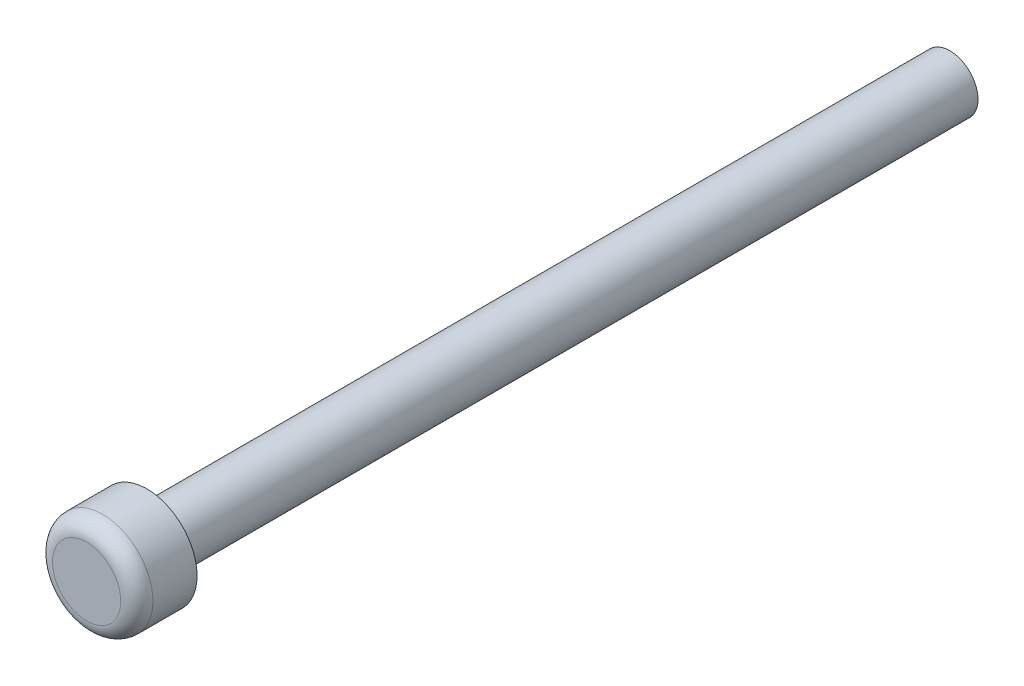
ISO-10303-21;
HEADER;
FILE_DESCRIPTION(('STEP AP214'),'2;1');
FILE_NAME('part.step','',(''),(''),'','','');
FILE_SCHEMA(('AUTOMOTIVE_DESIGN { 1 0 10303 214 1 1 1 1 }'));
ENDSEC;
DATA;
#1=APPLICATION_CONTEXT('core data for automotive mechanical design processes');
#2=APPLICATION_PROTOCOL_DEFINITION('international standard','automotive_design',2000,#1);
#3=PRODUCT_CONTEXT('',#1,'mechanical');
#4=PRODUCT('Part','Part','',(#3));
#5=PRODUCT_RELATED_PRODUCT_CATEGORY('part','',(#4));
#6=PRODUCT_DEFINITION_FORMATION('','',#4);
#7=PRODUCT_DEFINITION_CONTEXT('part definition',#1,'design');
#8=PRODUCT_DEFINITION('design','',#6,#7);
#9=PRODUCT_DEFINITION_SHAPE('','',#8);
#10=(LENGTH_UNIT() NAMED_UNIT(*) SI_UNIT(.MILLI.,.METRE.));
#11=(NAMED_UNIT(*) PLANE_ANGLE_UNIT() SI_UNIT($,.RADIAN.));
#12=(NAMED_UNIT(*) SI_UNIT($,.STERADIAN.) SOLID_ANGLE_UNIT());
#13=UNCERTAINTY_MEASURE_WITH_UNIT(LENGTH_MEASURE(1.E-05),#10,'distance_accuracy_value','');
#14=(GEOMETRIC_REPRESENTATION_CONTEXT(3) GLOBAL_UNCERTAINTY_ASSIGNED_CONTEXT((#13)) GLOBAL_UNIT_ASSIGNED_CONTEXT((#10,
#11,#12)) REPRESENTATION_CONTEXT('',''));
#15=CARTESIAN_POINT('',(0.,0.,0.));
#16=DIRECTION('',(0.,0.,1.));
#17=DIRECTION('',(1.,0.,0.));
#18=AXIS2_PLACEMENT_3D('',#15,#16,#17);
#19=CARTESIAN_POINT('',(212.5,139.,-120.));
#20=DIRECTION('',(0.,0.,1.));
#21=DIRECTION('',(1.,0.,0.));
#22=AXIS2_PLACEMENT_3D('',#19,#20,#21);
#23=CYLINDRICAL_SURFACE('',#22,7.00000000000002);
#24=CARTESIAN_POINT('',(212.5,139.,-120.));
#25=DIRECTION('',(0.,0.,1.));
#26=DIRECTION('',(1.,0.,0.));
#27=AXIS2_PLACEMENT_3D('',#24,#25,#26);
#28=CIRCLE('',#27,7.00000000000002);
#29=CARTESIAN_POINT('',(219.5,139.,-120.));
#30=VERTEX_POINT('',#29);
#31=EDGE_CURVE('E60',#30,#30,#28,.T.);
#32=CARTESIAN_POINT('',(212.5,139.,80.));
#33=DIRECTION('',(0.,0.,1.));
#34=DIRECTION('',(1.,0.,0.));
#35=AXIS2_PLACEMENT_3D('',#32,#33,#34);
#36=CIRCLE('',#35,7.00000000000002);
#37=CARTESIAN_POINT('',(219.5,139.,80.));
#38=VERTEX_POINT('',#37);
#39=EDGE_CURVE('E65',#38,#38,#36,.T.);
#40=CARTESIAN_POINT('',(219.5,139.,-120.));
#41=CARTESIAN_POINT('',(219.5,139.,-117.916666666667));
#42=CARTESIAN_POINT('',(219.5,139.,-115.833333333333));
#43=CARTESIAN_POINT('',(219.5,139.,-111.666666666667));
#44=CARTESIAN_POINT('',(219.5,139.,-109.583333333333));
#45=CARTESIAN_POINT('',(219.5,139.,-105.416666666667));
#46=CARTESIAN_POINT('',(219.5,139.,-103.333333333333));
#47=CARTESIAN_POINT('',(219.5,139.,-99.1666666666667));
#48=CARTESIAN_POINT('',(219.5,139.,-97.0833333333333));
#49=CARTESIAN_POINT('',(219.5,139.,-92.9166666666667));
#50=CARTESIAN_POINT('',(219.5,139.,-90.8333333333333));
#51=CARTESIAN_POINT('',(219.5,139.,-86.6666666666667));
#52=CARTESIAN_POINT('',(219.5,139.,-84.5833333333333));
#53=CARTESIAN_POINT('',(219.5,139.,-80.4166666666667));
#54=CARTESIAN_POINT('',(219.5,139.,-78.3333333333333));
#55=CARTESIAN_POINT('',(219.5,139.,-74.1666666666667));
#56=CARTESIAN_POINT('',(219.5,139.,-72.0833333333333));
#57=CARTESIAN_POINT('',(219.5,139.,-67.9166666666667));
#58=CARTESIAN_POINT('',(219.5,139.,-65.8333333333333));
#59=CARTESIAN_POINT('',(219.5,139.,-61.6666666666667));
#60=CARTESIAN_POINT('',(219.5,139.,-59.5833333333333));
#61=CARTESIAN_POINT('',(219.5,139.,-55.4166666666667));
#62=CARTESIAN_POINT('',(219.5,139.,-53.3333333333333));
#63=CARTESIAN_POINT('',(219.5,139.,-49.1666666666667));
#64=CARTESIAN_POINT('',(219.5,139.,-47.0833333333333));
#65=CARTESIAN_POINT('',(219.5,139.,-42.9166666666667));
#66=CARTESIAN_POINT('',(219.5,139.,-40.8333333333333));
#67=CARTESIAN_POINT('',(219.5,139.,-36.6666666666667));
#68=CARTESIAN_POINT('',(219.5,139.,-34.5833333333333));
#69=CARTESIAN_POINT('',(219.5,139.,-30.4166666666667));
#70=CARTESIAN_POINT('',(219.5,139.,-28.3333333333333));
#71=CARTESIAN_POINT('',(219.5,139.,-24.1666666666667));
#72=CARTESIAN_POINT('',(219.5,139.,-22.0833333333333));
#73=CARTESIAN_POINT('',(219.5,139.,-17.9166666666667));
#74=CARTESIAN_POINT('',(219.5,139.,-15.8333333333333));
#75=CARTESIAN_POINT('',(219.5,139.,-11.6666666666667));
#76=CARTESIAN_POINT('',(219.5,139.,-9.58333333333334));
#77=CARTESIAN_POINT('',(219.5,139.,-5.41666666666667));
#78=CARTESIAN_POINT('',(219.5,139.,-3.33333333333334));
#79=CARTESIAN_POINT('',(219.5,139.,0.833333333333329));
#80=CARTESIAN_POINT('',(219.5,139.,2.91666666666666));
#81=CARTESIAN_POINT('',(219.5,139.,7.08333333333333));
#82=CARTESIAN_POINT('',(219.5,139.,9.16666666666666));
#83=CARTESIAN_POINT('',(219.5,139.,13.3333333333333));
#84=CARTESIAN_POINT('',(219.5,139.,15.4166666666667));
#85=CARTESIAN_POINT('',(219.5,139.,19.5833333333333));
#86=CARTESIAN_POINT('',(219.5,139.,21.6666666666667));
#87=CARTESIAN_POINT('',(219.5,139.,25.8333333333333));
#88=CARTESIAN_POINT('',(219.5,139.,27.9166666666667));
#89=CARTESIAN_POINT('',(219.5,139.,32.0833333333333));
#90=CARTESIAN_POINT('',(219.5,139.,34.1666666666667));
#91=CARTESIAN_POINT('',(219.5,139.,38.3333333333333));
#92=CARTESIAN_POINT('',(219.5,139.,40.4166666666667));
#93=CARTESIAN_POINT('',(219.5,139.,44.5833333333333));
#94=CARTESIAN_POINT('',(219.5,139.,46.6666666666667));
#95=CARTESIAN_POINT('',(219.5,139.,50.8333333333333));
#96=CARTESIAN_POINT('',(219.5,139.,52.9166666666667));
#97=CARTESIAN_POINT('',(219.5,139.,57.0833333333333));
#98=CARTESIAN_POINT('',(219.5,139.,59.1666666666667));
#99=CARTESIAN_POINT('',(219.5,139.,63.3333333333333));
#100=CARTESIAN_POINT('',(219.5,139.,65.4166666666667));
#101=CARTESIAN_POINT('',(219.5,139.,69.5833333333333));
#102=CARTESIAN_POINT('',(219.5,139.,71.6666666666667));
#103=CARTESIAN_POINT('',(219.5,139.,75.8333333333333));
#104=CARTESIAN_POINT('',(219.5,139.,77.9166666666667));
#105=CARTESIAN_POINT('',(219.5,139.,80.));
#106=B_SPLINE_CURVE_WITH_KNOTS('',3,(#40,#41,#42,#43,#44,#45,#46,#47,#48,#49,#50,#51,#52,#53,
#54,#55,#56,#57,#58,#59,#60,#61,#62,#63,#64,#65,#66,#67,#68,#69,#70,#71,#72,#73,#74,#75,#76,#77,
#78,#79,#80,#81,#82,#83,#84,#85,#86,#87,#88,#89,#90,#91,#92,#93,#94,#95,#96,#97,#98,#99,#100,
#101,#102,#103,#104,#105),.UNSPECIFIED.,.F.,.F.,(4,2,2,2,2,2,2,2,2,2,2,2,2,2,2,2,2,2,2,2,2,2,2,
2,2,2,2,2,2,2,2,2,4),(0.,6.25000000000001,12.5,18.75,25.,31.25,37.5,43.75,50.,56.25,62.5,68.75,
75.,81.25,87.5,93.75,100.,106.25,112.5,118.75,125.,131.25,137.5,143.75,150.,156.25,162.5,168.75,
175.,181.25,187.5,193.75,200.),.UNSPECIFIED.);
#107=EDGE_CURVE('BSEAM47',#30,#38,#106,.T.);
#108=ORIENTED_EDGE('',*,*,#31,.T.);
#109=ORIENTED_EDGE('',*,*,#39,.F.);
#110=ORIENTED_EDGE('',*,*,#107,.T.);
#111=ORIENTED_EDGE('',*,*,#107,.F.);
#112=EDGE_LOOP('',(#108,#110,#109,#111));
#113=FACE_BOUND('',#112,.T.);
#114=ADVANCED_FACE('F47',(#113),#23,.T.);
#115=CARTESIAN_POINT('',(212.5,139.,-120.));
#116=DIRECTION('',(0.,0.,1.));
#117=DIRECTION('',(1.,0.,0.));
#118=AXIS2_PLACEMENT_3D('',#115,#116,#117);
#119=PLANE('',#118);
#120=ORIENTED_EDGE('',*,*,#31,.F.);
#121=EDGE_LOOP('',(#120));
#122=FACE_BOUND('',#121,.T.);
#123=ADVANCED_FACE('F93',(#122),#119,.F.);
#124=CARTESIAN_POINT('',(212.5,139.,95.));
#125=DIRECTION('',(0.,0.,-1.));
#126=DIRECTION('',(-1.,0.,0.));
#127=AXIS2_PLACEMENT_3D('',#124,#125,#126);
#128=CYLINDRICAL_SURFACE('',#127,12.5);
#129=CARTESIAN_POINT('',(212.5,139.,91.));
#130=DIRECTION('',(0.,0.,1.));
#131=DIRECTION('',(1.,0.,0.));
#132=AXIS2_PLACEMENT_3D('',#129,#130,#131);
#133=CIRCLE('',#132,12.5);
#134=CARTESIAN_POINT('',(225.,139.,91.));
#135=VERTEX_POINT('',#134);
#136=EDGE_CURVE('E10',#135,#135,#133,.F.);
#137=ORIENTED_EDGE('',*,*,#136,.T.);
#138=EDGE_LOOP('',(#137));
#139=FACE_BOUND('',#138,.T.);
#140=CARTESIAN_POINT('',(212.5,139.,80.));
#141=DIRECTION('',(0.,0.,1.));
#142=DIRECTION('',(1.,0.,0.));
#143=AXIS2_PLACEMENT_3D('',#140,#141,#142);
#144=CIRCLE('',#143,12.5);
#145=CARTESIAN_POINT('',(225.,139.,80.));
#146=VERTEX_POINT('',#145);
#147=EDGE_CURVE('E71',#146,#146,#144,.T.);
#148=ORIENTED_EDGE('',*,*,#147,.T.);
#149=EDGE_LOOP('',(#148));
#150=FACE_BOUND('',#149,.T.);
#151=ADVANCED_FACE('F76',(#139,#150),#128,.T.);
#152=CARTESIAN_POINT('',(212.5,139.,95.));
#153=DIRECTION('',(0.,0.,1.));
#154=DIRECTION('',(1.,0.,0.));
#155=AXIS2_PLACEMENT_3D('',#152,#153,#154);
#156=PLANE('',#155);
#157=CARTESIAN_POINT('',(212.5,139.,95.));
#158=DIRECTION('',(0.,0.,1.));
#159=DIRECTION('',(1.,0.,0.));
#160=AXIS2_PLACEMENT_3D('',#157,#158,#159);
#161=CIRCLE('',#160,8.50000000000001);
#162=CARTESIAN_POINT('',(221.,139.,95.));
#163=VERTEX_POINT('',#162);
#164=EDGE_CURVE('E55',#163,#163,#161,.T.);
#165=ORIENTED_EDGE('',*,*,#164,.T.);
#166=EDGE_LOOP('',(#165));
#167=FACE_BOUND('',#166,.T.);
#168=ADVANCED_FACE('F80',(#167),#156,.T.);
#169=CARTESIAN_POINT('',(212.5,139.,80.));
#170=DIRECTION('',(0.,0.,1.));
#171=DIRECTION('',(1.,0.,0.));
#172=AXIS2_PLACEMENT_3D('',#169,#170,#171);
#173=PLANE('',#172);
#174=ORIENTED_EDGE('',*,*,#39,.T.);
#175=EDGE_LOOP('',(#174));
#176=FACE_BOUND('',#175,.T.);
#177=ORIENTED_EDGE('',*,*,#147,.F.);
#178=EDGE_LOOP('',(#177));
#179=FACE_BOUND('',#178,.T.);
#180=ADVANCED_FACE('F78',(#176,#179),#173,.F.);
#181=CARTESIAN_POINT('',(212.5,139.,91.));
#182=DIRECTION('',(0.,0.,1.));
#183=DIRECTION('',(1.,0.,0.));
#184=AXIS2_PLACEMENT_3D('',#181,#182,#183);
#185=TOROIDAL_SURFACE('',#184,8.50000000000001,4.);
#186=ORIENTED_EDGE('',*,*,#136,.F.);
#187=EDGE_LOOP('',(#186));
#188=FACE_BOUND('',#187,.T.);
#189=ORIENTED_EDGE('',*,*,#164,.F.);
#190=EDGE_LOOP('',(#189));
#191=FACE_BOUND('',#190,.T.);
#192=ADVANCED_FACE('F49',(#188,#191),#185,.T.);
#193=CLOSED_SHELL('',(#114,#123,#151,#168,#180,#192));
#194=MANIFOLD_SOLID_BREP('B2',#193);
#195=ADVANCED_BREP_SHAPE_REPRESENTATION('',(#18,#194),#14);
#196=SHAPE_DEFINITION_REPRESENTATION(#9,#195);
ENDSEC;
END-ISO-10303-21;
